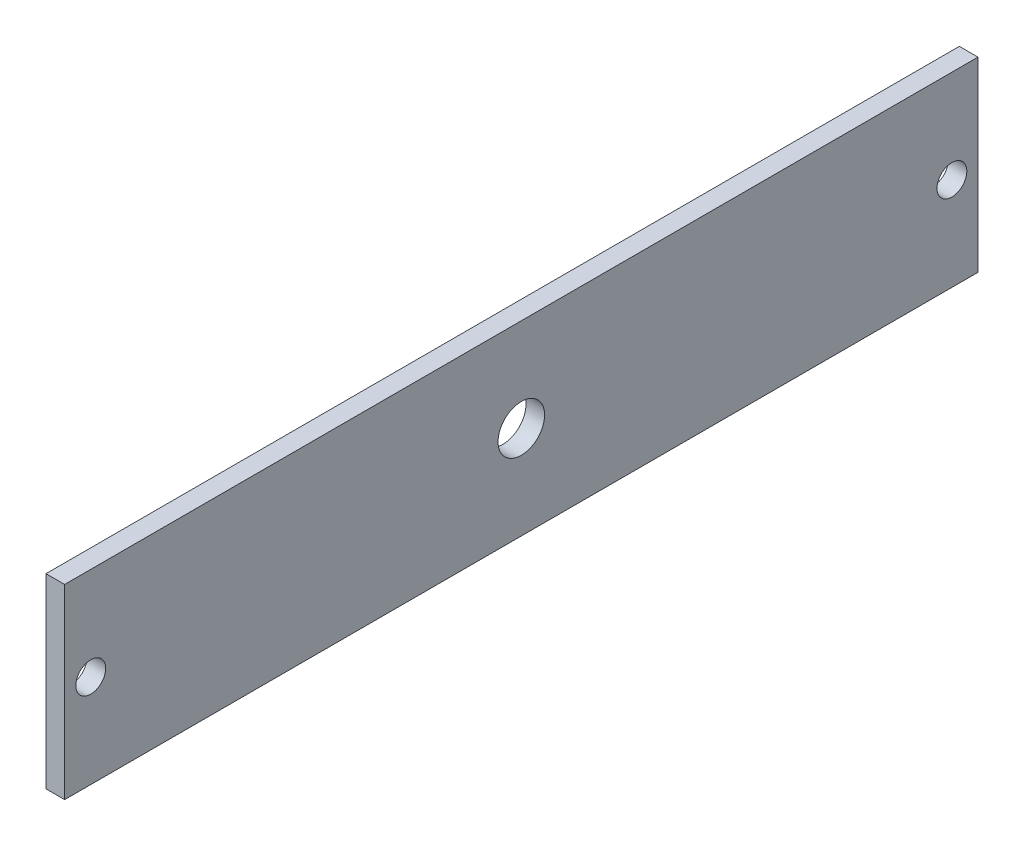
from build123d import *

# Parameters (mm, degrees)
SKETCH1_W           = 124.46
SKETCH1_H           = 25.4
BOSS_EXTRUDE1_DEPTH = 2.54
SKETCH2_R           = 2.032
CUT_EXTRUDE1_DEPTH  = 2.54
SKETCH5_R           = 3.175
CUT_EXTRUDE2_DEPTH  = 2.54


with BuildPart() as part:
    # Sketch1 → Boss-Extrude1 (new body)
    with BuildSketch(Plane(origin=(0, 0, 0), x_dir=(0, 0, -1), z_dir=(1, 0, 0))):
        with Locations((-62.23, 12.7)):
            Rectangle(SKETCH1_W, SKETCH1_H)
    extrude(amount=BOSS_EXTRUDE1_DEPTH)

    # Sketch2 → Cut-Extrude1 (cut)
    with BuildSketch(Plane(origin=(2.54, 0, 0), x_dir=(0, 0, -1), z_dir=(1, 0, 0))):
        with Locations((-120.904, 12.7)):
            Circle(SKETCH2_R)
        with Locations(Location((-3.556, 12.7, 0), (0, 0, 180))):
            Circle(SKETCH2_R)
    extrude(amount=-CUT_EXTRUDE1_DEPTH, mode=Mode.SUBTRACT)

    # Sketch5 → Cut-Extrude2 (cut)
    with BuildSketch(Plane(origin=(2.54, 0, 0), x_dir=(0, 0, -1), z_dir=(1, 0, 0))):
        with Locations((-62.23, 12.7)):
            Circle(SKETCH5_R)
    extrude(amount=-CUT_EXTRUDE2_DEPTH, mode=Mode.SUBTRACT)


solid = part.part
